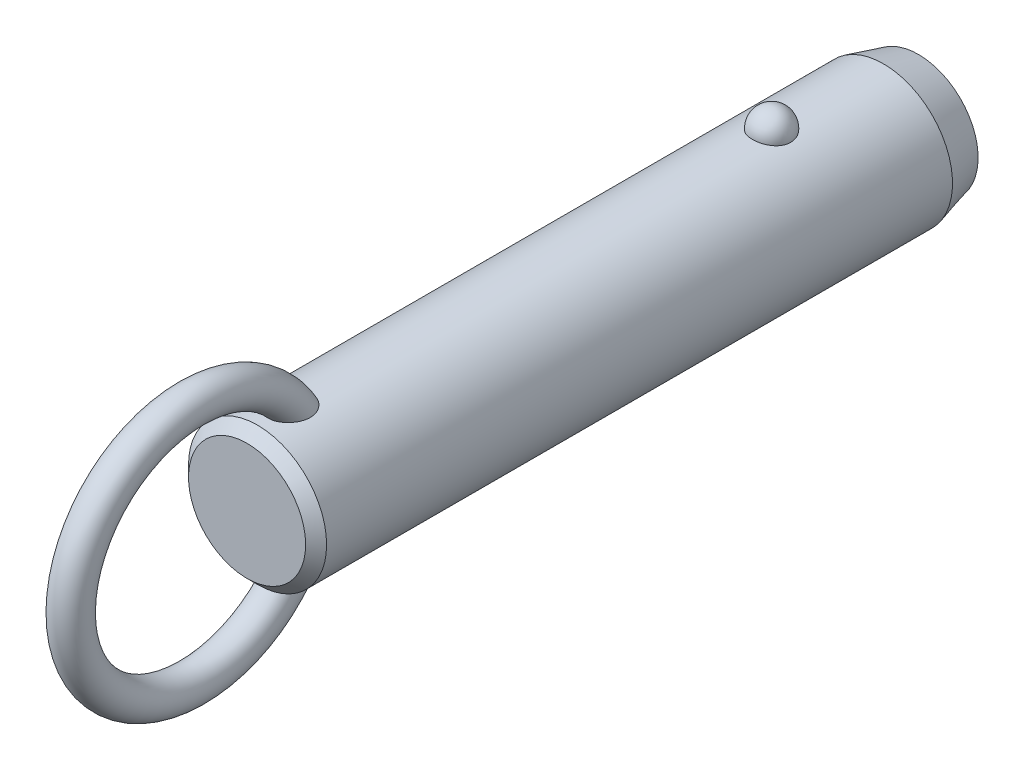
ISO-10303-21;
HEADER;
FILE_DESCRIPTION(('STEP AP214'),'2;1');
FILE_NAME('part.step','',(''),(''),'','','');
FILE_SCHEMA(('AUTOMOTIVE_DESIGN { 1 0 10303 214 1 1 1 1 }'));
ENDSEC;
DATA;
#1=APPLICATION_CONTEXT('core data for automotive mechanical design processes');
#2=APPLICATION_PROTOCOL_DEFINITION('international standard','automotive_design',2000,#1);
#3=PRODUCT_CONTEXT('',#1,'mechanical');
#4=PRODUCT('Part','Part','',(#3));
#5=PRODUCT_RELATED_PRODUCT_CATEGORY('part','',(#4));
#6=PRODUCT_DEFINITION_FORMATION('','',#4);
#7=PRODUCT_DEFINITION_CONTEXT('part definition',#1,'design');
#8=PRODUCT_DEFINITION('design','',#6,#7);
#9=PRODUCT_DEFINITION_SHAPE('','',#8);
#10=(LENGTH_UNIT() NAMED_UNIT(*) SI_UNIT(.MILLI.,.METRE.));
#11=(NAMED_UNIT(*) PLANE_ANGLE_UNIT() SI_UNIT($,.RADIAN.));
#12=(NAMED_UNIT(*) SI_UNIT($,.STERADIAN.) SOLID_ANGLE_UNIT());
#13=UNCERTAINTY_MEASURE_WITH_UNIT(LENGTH_MEASURE(1.E-05),#10,'distance_accuracy_value','');
#14=(GEOMETRIC_REPRESENTATION_CONTEXT(3) GLOBAL_UNCERTAINTY_ASSIGNED_CONTEXT((#13)) GLOBAL_UNIT_ASSIGNED_CONTEXT((#10,
#11,#12)) REPRESENTATION_CONTEXT('',''));
#15=CARTESIAN_POINT('',(0.,0.,0.));
#16=DIRECTION('',(0.,0.,1.));
#17=DIRECTION('',(1.,0.,0.));
#18=AXIS2_PLACEMENT_3D('',#15,#16,#17);
#19=CARTESIAN_POINT('',(0.,0.,48.3));
#20=DIRECTION('',(0.,0.,-1.));
#21=DIRECTION('',(-1.,0.,0.));
#22=AXIS2_PLACEMENT_3D('',#19,#20,#21);
#23=CYLINDRICAL_SURFACE('',#22,7.9);
#24=CARTESIAN_POINT('',(2.1785689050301,7.59367088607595,-2.2));
#25=CARTESIAN_POINT('',(2.17856679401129,7.59367269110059,-2.07701843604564));
#26=CARTESIAN_POINT('',(2.16853481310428,7.59657145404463,-1.95401006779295));
#27=CARTESIAN_POINT('',(2.12864689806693,7.607843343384,-1.71147811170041));
#28=CARTESIAN_POINT('',(2.09878338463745,7.61621856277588,-1.59195587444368));
#29=CARTESIAN_POINT('',(2.0199931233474,7.63749180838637,-1.35985638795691));
#30=CARTESIAN_POINT('',(1.97107475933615,7.6503878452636,-1.24727610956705));
#31=CARTESIAN_POINT('',(1.85539377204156,7.67926115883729,-1.03213234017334));
#32=CARTESIAN_POINT('',(1.78863158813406,7.69523835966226,-0.929568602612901));
#33=CARTESIAN_POINT('',(1.63856494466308,7.7285848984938,-0.736786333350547));
#34=CARTESIAN_POINT('',(1.55518140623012,7.7459606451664,-0.64663044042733));
#35=CARTESIAN_POINT('',(1.37422937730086,7.78009978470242,-0.481747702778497));
#36=CARTESIAN_POINT('',(1.27666086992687,7.79686317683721,-0.4070208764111));
#37=CARTESIAN_POINT('',(1.07024728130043,7.82786153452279,-0.275278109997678));
#38=CARTESIAN_POINT('',(0.961434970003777,7.84210353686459,-0.218212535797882));
#39=CARTESIAN_POINT('',(0.735351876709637,7.86652194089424,-0.123146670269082));
#40=CARTESIAN_POINT('',(0.618082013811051,7.87669878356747,-0.0851443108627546));
#41=CARTESIAN_POINT('',(0.380637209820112,7.89170521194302,-0.0298158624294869));
#42=CARTESIAN_POINT('',(0.260550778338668,7.89662650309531,-0.0121347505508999));
#43=CARTESIAN_POINT('',(0.0190117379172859,7.90090003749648,0.00324379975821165));
#44=CARTESIAN_POINT('',(-0.102440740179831,7.90025280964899,0.000943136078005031));
#45=CARTESIAN_POINT('',(-0.341452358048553,7.89351056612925,-0.0233955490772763));
#46=CARTESIAN_POINT('',(-0.459042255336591,7.88749257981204,-0.045154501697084));
#47=CARTESIAN_POINT('',(-0.688796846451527,7.87075812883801,-0.107408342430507));
#48=CARTESIAN_POINT('',(-0.800961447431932,7.86004158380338,-0.147903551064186));
#49=CARTESIAN_POINT('',(-1.01743634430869,7.83497131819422,-0.246799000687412));
#50=CARTESIAN_POINT('',(-1.12169791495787,7.82059709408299,-0.30530057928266));
#51=CARTESIAN_POINT('',(-1.31891765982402,7.78976470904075,-0.438549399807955));
#52=CARTESIAN_POINT('',(-1.41187469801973,7.77330633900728,-0.513298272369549));
#53=CARTESIAN_POINT('',(-1.58577142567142,7.73972434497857,-0.678622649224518));
#54=CARTESIAN_POINT('',(-1.66645140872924,7.72259402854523,-0.769470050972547));
#55=CARTESIAN_POINT('',(-1.81161503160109,7.68983776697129,-0.963538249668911));
#56=CARTESIAN_POINT('',(-1.87609753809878,7.6742119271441,-1.06675991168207));
#57=CARTESIAN_POINT('',(-1.98790138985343,7.6460202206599,-1.28401170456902));
#58=CARTESIAN_POINT('',(-2.03501994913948,7.63349104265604,-1.39815107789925));
#59=CARTESIAN_POINT('',(-2.10986724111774,7.6131449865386,-1.63301784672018));
#60=CARTESIAN_POINT('',(-2.1375965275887,7.60532797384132,-1.75374505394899));
#61=CARTESIAN_POINT('',(-2.17289256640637,7.59531950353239,-1.99782562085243));
#62=CARTESIAN_POINT('',(-2.18054294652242,7.59310471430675,-2.12116592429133));
#63=CARTESIAN_POINT('',(-2.17572919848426,7.59448538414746,-2.36741799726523));
#64=CARTESIAN_POINT('',(-2.1632656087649,7.59808068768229,-2.49032977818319));
#65=CARTESIAN_POINT('',(-2.11865035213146,7.61064035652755,-2.73161015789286));
#66=CARTESIAN_POINT('',(-2.08659579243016,7.61957823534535,-2.84999812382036));
#67=CARTESIAN_POINT('',(-2.00367799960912,7.64179982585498,-3.07955956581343));
#68=CARTESIAN_POINT('',(-1.9528140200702,7.65508371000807,-3.19073275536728));
#69=CARTESIAN_POINT('',(-1.83321113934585,7.68460381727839,-3.40337899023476));
#70=CARTESIAN_POINT('',(-1.76437735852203,7.70085556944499,-3.50479651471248));
#71=CARTESIAN_POINT('',(-1.61069526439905,7.73445734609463,-3.69446912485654));
#72=CARTESIAN_POINT('',(-1.52584634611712,7.75180741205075,-3.78272371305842));
#73=CARTESIAN_POINT('',(-1.34198059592,7.78574608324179,-3.94393987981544));
#74=CARTESIAN_POINT('',(-1.24291308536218,7.80233167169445,-4.01684434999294));
#75=CARTESIAN_POINT('',(-1.03352039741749,7.83281625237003,-4.14489386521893));
#76=CARTESIAN_POINT('',(-0.923196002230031,7.84671543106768,-4.20004014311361));
#77=CARTESIAN_POINT('',(-0.695822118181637,7.87011575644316,-4.29042017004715));
#78=CARTESIAN_POINT('',(-0.578872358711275,7.87966903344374,-4.32589112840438));
#79=CARTESIAN_POINT('',(-0.340410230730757,7.8935652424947,-4.37692226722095));
#80=CARTESIAN_POINT('',(-0.218898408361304,7.89790879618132,-4.39248482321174));
#81=CARTESIAN_POINT('',(0.0228107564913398,7.90087453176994,-4.40314405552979));
#82=CARTESIAN_POINT('',(0.142990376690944,7.89960185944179,-4.39861683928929));
#83=CARTESIAN_POINT('',(0.380829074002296,7.89171262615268,-4.37008293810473));
#84=CARTESIAN_POINT('',(0.498488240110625,7.8850962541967,-4.34607694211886));
#85=CARTESIAN_POINT('',(0.727535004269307,7.86726442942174,-4.27939317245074));
#86=CARTESIAN_POINT('',(0.838944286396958,7.85606616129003,-4.23678512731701));
#87=CARTESIAN_POINT('',(1.05295421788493,7.83025654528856,-4.13408348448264));
#88=CARTESIAN_POINT('',(1.15555431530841,7.81564498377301,-4.07398879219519));
#89=CARTESIAN_POINT('',(1.35076763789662,7.7843022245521,-3.93687432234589));
#90=CARTESIAN_POINT('',(1.4432046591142,7.76754209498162,-3.85961036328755));
#91=CARTESIAN_POINT('',(1.6139111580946,7.73387857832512,-3.69076949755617));
#92=CARTESIAN_POINT('',(1.6921781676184,7.71697516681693,-3.59919010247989));
#93=CARTESIAN_POINT('',(1.83380875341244,7.6845643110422,-3.40247278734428));
#94=CARTESIAN_POINT('',(1.89689280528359,7.66908588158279,-3.29712873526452));
#95=CARTESIAN_POINT('',(2.0047823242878,7.64159441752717,-3.07707931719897));
#96=CARTESIAN_POINT('',(2.0495945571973,7.62958010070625,-2.96237743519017));
#97=CARTESIAN_POINT('',(2.11580183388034,7.61146617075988,-2.74040519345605));
#98=CARTESIAN_POINT('',(2.13929812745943,7.60484503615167,-2.63379846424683));
#99=CARTESIAN_POINT('',(2.17068242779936,7.59594664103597,-2.41813481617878));
#100=CARTESIAN_POINT('',(2.17857077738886,7.59366928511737,-2.30907795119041));
#101=CARTESIAN_POINT('',(2.1785689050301,7.59367088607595,-2.2));
#102=B_SPLINE_CURVE_WITH_KNOTS('',3,(#24,#25,#26,#27,#28,#29,#30,#31,#32,#33,#34,#35,#36,#37,
#38,#39,#40,#41,#42,#43,#44,#45,#46,#47,#48,#49,#50,#51,#52,#53,#54,#55,#56,#57,#58,#59,#60,#61,
#62,#63,#64,#65,#66,#67,#68,#69,#70,#71,#72,#73,#74,#75,#76,#77,#78,#79,#80,#81,#82,#83,#84,#85,
#86,#87,#88,#89,#90,#91,#92,#93,#94,#95,#96,#97,#98,#99,#100,#101),.UNSPECIFIED.,.T.,.F.,(4,2,2,
2,2,2,2,2,2,2,2,2,2,2,2,2,2,2,2,2,2,2,2,2,2,2,2,2,2,2,2,2,2,2,2,2,2,2,4),(0.,0.368552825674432,
0.737246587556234,1.10577831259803,1.4743009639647,1.84462067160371,2.21494081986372,
2.5842105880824,2.95344028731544,3.31611630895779,3.67875788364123,4.03628044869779,
4.39380913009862,4.75338791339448,5.11300280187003,5.47939989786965,5.8458226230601,
6.21639834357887,6.58696347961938,6.95598276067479,7.32499216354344,7.69218715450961,
8.0593967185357,8.42858578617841,8.79778880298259,9.16834203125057,9.5388695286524,
9.90482699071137,10.2707407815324,10.6298333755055,10.9889132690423,11.3466585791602,
11.7044262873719,12.0676511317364,12.4309391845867,12.8004764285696,13.1698767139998,
13.4967701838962,13.8236564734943),.UNSPECIFIED.);
#103=CARTESIAN_POINT('',(2.1785689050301,7.59367088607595,-2.2));
#104=VERTEX_POINT('',#103);
#105=EDGE_CURVE('E41',#104,#104,#102,.T.);
#106=ORIENTED_EDGE('',*,*,#105,.T.);
#107=EDGE_LOOP('',(#106));
#108=FACE_BOUND('',#107,.T.);
#109=CARTESIAN_POINT('',(0.,0.,56.62));
#110=DIRECTION('',(0.,0.,1.));
#111=DIRECTION('',(1.,0.,0.));
#112=AXIS2_PLACEMENT_3D('',#109,#110,#111);
#113=CIRCLE('',#112,7.9);
#114=CARTESIAN_POINT('',(7.9,0.,56.62));
#115=VERTEX_POINT('',#114);
#116=EDGE_CURVE('E10',#115,#115,#113,.F.);
#117=ORIENTED_EDGE('',*,*,#116,.T.);
#118=EDGE_LOOP('',(#117));
#119=FACE_BOUND('',#118,.T.);
#120=CARTESIAN_POINT('',(-0.630969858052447,-7.87476203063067,50.5124322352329));
#121=CARTESIAN_POINT('',(-0.734180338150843,-7.8664899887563,50.547285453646));
#122=CARTESIAN_POINT('',(-0.83447695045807,-7.85639291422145,50.5908160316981));
#123=CARTESIAN_POINT('',(-1.0262035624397,-7.83366343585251,50.694094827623));
#124=CARTESIAN_POINT('',(-1.1176141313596,-7.82102565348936,50.7538775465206));
#125=CARTESIAN_POINT('',(-1.28877277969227,-7.79464922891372,50.8878390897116));
#126=CARTESIAN_POINT('',(-1.36854014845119,-7.78091246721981,50.961993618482));
#127=CARTESIAN_POINT('',(-1.51461521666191,-7.75380398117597,51.1224941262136));
#128=CARTESIAN_POINT('',(-1.58092966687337,-7.74043207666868,51.2088339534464));
#129=CARTESIAN_POINT('',(-1.70019064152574,-7.71512522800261,51.3929784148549));
#130=CARTESIAN_POINT('',(-1.75284037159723,-7.70322473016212,51.4909792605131));
#131=CARTESIAN_POINT('',(-1.84263464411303,-7.68224112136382,51.6941029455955));
#132=CARTESIAN_POINT('',(-1.87977299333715,-7.6731591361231,51.7992286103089));
#133=CARTESIAN_POINT('',(-1.94152728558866,-7.65777930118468,52.0232849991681));
#134=CARTESIAN_POINT('',(-1.96475471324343,-7.65179654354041,52.1426167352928));
#135=CARTESIAN_POINT('',(-1.99449499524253,-7.64409642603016,52.3834298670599));
#136=CARTESIAN_POINT('',(-2.0010005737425,-7.64238092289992,52.5049121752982));
#137=CARTESIAN_POINT('',(-1.99856014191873,-7.64302120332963,52.7683409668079));
#138=CARTESIAN_POINT('',(-1.98680021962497,-7.64611845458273,52.9102565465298));
#139=CARTESIAN_POINT('',(-1.94457772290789,-7.65696186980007,53.1911188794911));
#140=CARTESIAN_POINT('',(-1.91409393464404,-7.66471330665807,53.3300620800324));
#141=CARTESIAN_POINT('',(-1.82768670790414,-7.68582947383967,53.631939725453));
#142=CARTESIAN_POINT('',(-1.76772963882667,-7.70003779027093,53.793686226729));
#143=CARTESIAN_POINT('',(-1.65998501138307,-7.72371550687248,54.0276956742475));
#144=CARTESIAN_POINT('',(-1.621079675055,-7.73200670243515,54.1042974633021));
#145=CARTESIAN_POINT('',(-1.53727726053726,-7.74910377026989,54.2540798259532));
#146=CARTESIAN_POINT('',(-1.49238215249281,-7.75790947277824,54.3272615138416));
#147=CARTESIAN_POINT('',(-1.37397050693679,-7.77993338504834,54.5028838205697));
#148=CARTESIAN_POINT('',(-1.29690364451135,-7.79328473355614,54.6029557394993));
#149=CARTESIAN_POINT('',(-1.12885487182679,-7.81939266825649,54.7907147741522));
#150=CARTESIAN_POINT('',(-1.03789926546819,-7.83215032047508,54.8784247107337));
#151=CARTESIAN_POINT('',(-0.869532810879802,-7.85231710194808,55.0134148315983));
#152=CARTESIAN_POINT('',(-0.795716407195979,-7.86021093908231,55.065076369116));
#153=CARTESIAN_POINT('',(-0.640813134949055,-7.87434920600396,55.1563815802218));
#154=CARTESIAN_POINT('',(-0.559737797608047,-7.88059619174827,55.1960438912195));
#155=CARTESIAN_POINT('',(-0.406456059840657,-7.88984116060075,55.2543008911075));
#156=CARTESIAN_POINT('',(-0.335227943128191,-7.89321892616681,55.2753848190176));
#157=CARTESIAN_POINT('',(-0.190193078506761,-7.89804235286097,55.3054141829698));
#158=CARTESIAN_POINT('',(-0.116388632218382,-7.89948969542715,55.3143701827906));
#159=CARTESIAN_POINT('',(0.0318414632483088,-7.90028409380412,55.3192915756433));
#160=CARTESIAN_POINT('',(0.106268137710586,-7.89962640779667,55.3152276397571));
#161=CARTESIAN_POINT('',(0.25329066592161,-7.8962818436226,55.2944615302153));
#162=CARTESIAN_POINT('',(0.325885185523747,-7.8935935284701,55.2777504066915));
#163=CARTESIAN_POINT('',(0.48144171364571,-7.88577340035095,55.2287380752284));
#164=CARTESIAN_POINT('',(0.563611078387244,-7.88026321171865,55.194005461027));
#165=CARTESIAN_POINT('',(0.721129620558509,-7.86741729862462,55.1117965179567));
#166=CARTESIAN_POINT('',(0.796466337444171,-7.86007832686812,55.0642975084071));
#167=CARTESIAN_POINT('',(0.971456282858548,-7.84073285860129,54.936513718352));
#168=CARTESIAN_POINT('',(1.06719686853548,-7.82809461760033,54.8510047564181));
#169=CARTESIAN_POINT('',(1.24418921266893,-7.80192439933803,54.666232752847));
#170=CARTESIAN_POINT('',(1.32540832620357,-7.78839049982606,54.5669395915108));
#171=CARTESIAN_POINT('',(1.45199971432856,-7.76559693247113,54.3895760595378));
#172=CARTESIAN_POINT('',(1.50085649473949,-7.75626094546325,54.3139542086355));
#173=CARTESIAN_POINT('',(1.59197749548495,-7.7380727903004,54.1587428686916));
#174=CARTESIAN_POINT('',(1.63423919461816,-7.72922080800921,54.0791518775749));
#175=CARTESIAN_POINT('',(1.71222612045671,-7.71231959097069,53.9166640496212));
#176=CARTESIAN_POINT('',(1.74794516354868,-7.70427111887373,53.833764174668));
#177=CARTESIAN_POINT('',(1.81270113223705,-7.68929240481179,53.6652967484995));
#178=CARTESIAN_POINT('',(1.84173789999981,-7.68236218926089,53.5797291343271));
#179=CARTESIAN_POINT('',(1.89322698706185,-7.6698375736,53.4052870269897));
#180=CARTESIAN_POINT('',(1.91558744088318,-7.66426199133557,53.3163838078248));
#181=CARTESIAN_POINT('',(1.95281367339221,-7.65485915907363,53.1369696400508));
#182=CARTESIAN_POINT('',(1.96767946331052,-7.65103190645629,53.0464586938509));
#183=CARTESIAN_POINT('',(2.0002145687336,-7.64262981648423,52.7737320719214));
#184=CARTESIAN_POINT('',(2.00600691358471,-7.6410871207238,52.5897099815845));
#185=CARTESIAN_POINT('',(1.98445334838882,-7.64669564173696,52.2765019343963));
#186=CARTESIAN_POINT('',(1.96607186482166,-7.65149688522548,52.146618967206));
#187=CARTESIAN_POINT('',(1.90884967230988,-7.66597624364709,51.8916321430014));
#188=CARTESIAN_POINT('',(1.87002101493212,-7.67565148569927,51.766525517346));
#189=CARTESIAN_POINT('',(1.77063986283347,-7.69918471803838,51.5245401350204));
#190=CARTESIAN_POINT('',(1.70993724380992,-7.71307150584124,51.4077250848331));
#191=CARTESIAN_POINT('',(1.56733070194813,-7.74330306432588,51.1881444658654));
#192=CARTESIAN_POINT('',(1.48543692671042,-7.75964665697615,51.0853722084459));
#193=CARTESIAN_POINT('',(1.31346177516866,-7.79047523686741,50.9093800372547));
#194=CARTESIAN_POINT('',(1.22547278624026,-7.80495298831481,50.8341066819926));
#195=CARTESIAN_POINT('',(1.0372435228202,-7.83218597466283,50.7004864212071));
#196=CARTESIAN_POINT('',(0.937008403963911,-7.84494192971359,50.6421324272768));
#197=CARTESIAN_POINT('',(0.733599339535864,-7.86649045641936,50.5470270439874));
#198=CARTESIAN_POINT('',(0.630941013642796,-7.87547134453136,50.5092109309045));
#199=CARTESIAN_POINT('',(0.420465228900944,-7.88950708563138,50.4511160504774));
#200=CARTESIAN_POINT('',(0.312645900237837,-7.89456050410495,50.4308436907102));
#201=CARTESIAN_POINT('',(0.0960869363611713,-7.9001518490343,50.4084559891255));
#202=CARTESIAN_POINT('',(-0.0126341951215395,-7.90073226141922,50.4061698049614));
#203=CARTESIAN_POINT('',(-0.228766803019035,-7.89742350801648,50.4193678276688));
#204=CARTESIAN_POINT('',(-0.336180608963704,-7.89354403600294,50.4348134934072));
#205=CARTESIAN_POINT('',(-0.473410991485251,-7.88586871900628,50.4662177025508));
#206=CARTESIAN_POINT('',(-0.505257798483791,-7.88388984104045,50.4743541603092));
#207=CARTESIAN_POINT('',(-0.568481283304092,-7.87958326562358,50.4922083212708));
#208=CARTESIAN_POINT('',(-0.599857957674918,-7.87725556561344,50.5019260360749));
#209=CARTESIAN_POINT('',(-0.630969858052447,-7.87476203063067,50.5124322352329));
#210=B_SPLINE_CURVE_WITH_KNOTS('',3,(#120,#121,#122,#123,#124,#125,#126,#127,#128,#129,#130,
#131,#132,#133,#134,#135,#136,#137,#138,#139,#140,#141,#142,#143,#144,#145,#146,#147,#148,#149,
#150,#151,#152,#153,#154,#155,#156,#157,#158,#159,#160,#161,#162,#163,#164,#165,#166,#167,#168,
#169,#170,#171,#172,#173,#174,#175,#176,#177,#178,#179,#180,#181,#182,#183,#184,#185,#186,#187,
#188,#189,#190,#191,#192,#193,#194,#195,#196,#197,#198,#199,#200,#201,#202,#203,#204,#205,#206,
#207,#208,#209),.UNSPECIFIED.,.T.,.F.,(4,2,2,2,2,2,2,2,2,2,2,2,2,2,2,2,2,2,2,2,2,2,2,2,2,2,2,2,
2,2,2,2,2,2,2,2,2,2,2,2,2,2,2,2,4),(0.,0.327622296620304,0.655945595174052,0.983718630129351,
1.3113267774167,1.64554655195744,1.97989964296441,2.34365728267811,2.70757317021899,
3.13333684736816,3.55958380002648,4.07655306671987,4.3352789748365,4.593919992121,
4.9738243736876,5.35301797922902,5.62348245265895,5.89352465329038,6.11565959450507,
6.3376009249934,6.56004255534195,6.782641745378,7.04930844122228,7.31645206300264,
7.70130871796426,8.08701995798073,8.35824509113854,8.62957365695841,8.90115735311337,
9.17274746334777,9.44791855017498,9.72308922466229,10.2715298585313,10.6638393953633,
11.0559179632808,11.4507403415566,11.8453740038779,12.1936425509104,12.5417649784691,
12.8695063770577,13.1973674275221,13.5221104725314,13.8461490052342,13.9449071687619,
14.0436660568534),.UNSPECIFIED.);
#211=CARTESIAN_POINT('',(-0.630969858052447,-7.87476203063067,50.5124322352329));
#212=VERTEX_POINT('',#211);
#213=EDGE_CURVE('E59',#212,#212,#210,.T.);
#214=ORIENTED_EDGE('',*,*,#213,.T.);
#215=EDGE_LOOP('',(#214));
#216=FACE_BOUND('',#215,.T.);
#217=CARTESIAN_POINT('',(-0.630969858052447,7.87476203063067,50.5124322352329));
#218=CARTESIAN_POINT('',(-0.528918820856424,7.88293636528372,50.4779798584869));
#219=CARTESIAN_POINT('',(-0.423745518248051,7.8893481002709,50.451915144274));
#220=CARTESIAN_POINT('',(-0.210236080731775,7.8979273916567,50.4172825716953));
#221=CARTESIAN_POINT('',(-0.101893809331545,7.90008607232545,50.4087513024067));
#222=CARTESIAN_POINT('',(0.114660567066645,7.89990877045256,50.4094570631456));
#223=CARTESIAN_POINT('',(0.22287270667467,7.89757640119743,50.4186798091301));
#224=CARTESIAN_POINT('',(0.436107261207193,7.88867538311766,50.4546525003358));
#225=CARTESIAN_POINT('',(0.541131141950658,7.8821087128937,50.4813942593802));
#226=CARTESIAN_POINT('',(0.745085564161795,7.86545130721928,50.5517561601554));
#227=CARTESIAN_POINT('',(0.844015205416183,7.85536005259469,50.5953787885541));
#228=CARTESIAN_POINT('',(1.03299167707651,7.83275153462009,50.6983796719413));
#229=CARTESIAN_POINT('',(1.12303841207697,7.8202342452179,50.7577580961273));
#230=CARTESIAN_POINT('',(1.29214734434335,7.79408219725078,50.8908647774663));
#231=CARTESIAN_POINT('',(1.37116907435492,7.78044359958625,50.9646436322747));
#232=CARTESIAN_POINT('',(1.51597677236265,7.75353170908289,51.1242353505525));
#233=CARTESIAN_POINT('',(1.58176261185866,7.74025841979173,51.2100483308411));
#234=CARTESIAN_POINT('',(1.70057386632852,7.71504069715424,51.393644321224));
#235=CARTESIAN_POINT('',(1.75320073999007,7.7031425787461,51.4916906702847));
#236=CARTESIAN_POINT('',(1.8429376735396,7.68216822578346,51.6948931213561));
#237=CARTESIAN_POINT('',(1.88004278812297,7.67309289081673,51.8000514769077));
#238=CARTESIAN_POINT('',(1.9417232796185,7.6577294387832,52.0241671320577));
#239=CARTESIAN_POINT('',(1.96491037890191,7.65175648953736,52.1435248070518));
#240=CARTESIAN_POINT('',(1.9945689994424,7.64407702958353,52.3843848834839));
#241=CARTESIAN_POINT('',(2.00103304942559,7.64237242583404,52.5058882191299));
#242=CARTESIAN_POINT('',(1.99850166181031,7.64303650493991,52.7693688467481));
#243=CARTESIAN_POINT('',(1.98669038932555,7.64614714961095,52.9113141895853));
#244=CARTESIAN_POINT('',(1.94436120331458,7.6570170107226,53.1922287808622));
#245=CARTESIAN_POINT('',(1.91382203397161,7.66478150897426,53.3311944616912));
#246=CARTESIAN_POINT('',(1.82728754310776,7.68592483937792,53.6331110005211));
#247=CARTESIAN_POINT('',(1.76725778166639,7.7001468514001,53.7948721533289));
#248=CARTESIAN_POINT('',(1.65939700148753,7.72384204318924,54.0288914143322));
#249=CARTESIAN_POINT('',(1.62045187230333,7.73213852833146,54.1054942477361));
#250=CARTESIAN_POINT('',(1.5365668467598,7.74924489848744,54.2552737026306));
#251=CARTESIAN_POINT('',(1.49162892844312,7.75805461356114,54.3284514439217));
#252=CARTESIAN_POINT('',(1.37317698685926,7.78007342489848,54.5039520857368));
#253=CARTESIAN_POINT('',(1.29612360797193,7.79341423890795,54.6039112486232));
#254=CARTESIAN_POINT('',(1.12812043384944,7.81949839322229,54.7914508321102));
#255=CARTESIAN_POINT('',(1.03719688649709,7.83224280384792,54.8790540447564));
#256=CARTESIAN_POINT('',(0.868871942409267,7.85239026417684,55.0138971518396));
#257=CARTESIAN_POINT('',(0.795056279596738,7.86027769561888,55.0655113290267));
#258=CARTESIAN_POINT('',(0.640160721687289,7.87440222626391,55.1567201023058));
#259=CARTESIAN_POINT('',(0.559092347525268,7.88064188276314,55.1963333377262));
#260=CARTESIAN_POINT('',(0.40582092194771,7.8898738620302,55.2545056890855));
#261=CARTESIAN_POINT('',(0.334594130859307,7.89324577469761,55.2755523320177));
#262=CARTESIAN_POINT('',(0.189568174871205,7.89805733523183,55.3055070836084));
#263=CARTESIAN_POINT('',(0.115771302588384,7.89949866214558,55.3144257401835));
#264=CARTESIAN_POINT('',(-0.0324359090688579,7.90028156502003,55.3192758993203));
#265=CARTESIAN_POINT('',(-0.106847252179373,7.89961843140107,55.3151782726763));
#266=CARTESIAN_POINT('',(-0.253834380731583,7.8962642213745,55.2943519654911));
#267=CARTESIAN_POINT('',(-0.326408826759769,7.89357170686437,55.2776143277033));
#268=CARTESIAN_POINT('',(-0.481962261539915,7.88574179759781,55.2285391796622));
#269=CARTESIAN_POINT('',(-0.564145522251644,7.88022507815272,55.1937638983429));
#270=CARTESIAN_POINT('',(-0.72168526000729,7.86736646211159,55.1114686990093));
#271=CARTESIAN_POINT('',(-0.797029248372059,7.8600213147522,55.0639260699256));
#272=CARTESIAN_POINT('',(-0.9720442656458,7.84066026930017,54.9360267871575));
#273=CARTESIAN_POINT('',(-1.06779803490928,7.82801274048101,54.8504436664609));
#274=CARTESIAN_POINT('',(-1.2448053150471,7.80182621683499,54.6655223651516));
#275=CARTESIAN_POINT('',(-1.32602618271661,7.78828530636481,54.5661540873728));
#276=CARTESIAN_POINT('',(-1.45259834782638,7.76548487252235,54.3886806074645));
#277=CARTESIAN_POINT('',(-1.50143856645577,7.75614818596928,54.3130252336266));
#278=CARTESIAN_POINT('',(-1.59252410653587,7.73796020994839,54.1577484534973));
#279=CARTESIAN_POINT('',(-1.63476690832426,7.72910910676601,54.0781255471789));
#280=CARTESIAN_POINT('',(-1.71271318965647,7.71221133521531,53.9155750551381));
#281=CARTESIAN_POINT('',(-1.7484104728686,7.70416543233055,53.8326444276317));
#282=CARTESIAN_POINT('',(-1.81311929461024,7.6891937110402,53.6641168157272));
#283=CARTESIAN_POINT('',(-1.84213067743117,7.6822679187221,53.5785197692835));
#284=CARTESIAN_POINT('',(-1.89356259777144,7.66975461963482,53.4040254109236));
#285=CARTESIAN_POINT('',(-1.91589165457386,7.66418586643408,53.3150995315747));
#286=CARTESIAN_POINT('',(-1.95305070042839,7.65479859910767,53.1356424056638));
#287=CARTESIAN_POINT('',(-1.96788069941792,7.65098008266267,53.0451111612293));
#288=CARTESIAN_POINT('',(-2.00030078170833,7.64260704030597,52.7723270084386));
#289=CARTESIAN_POINT('',(-2.00600576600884,7.64108760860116,52.5882718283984));
#290=CARTESIAN_POINT('',(-1.98428483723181,7.64673945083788,52.2750800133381));
#291=CARTESIAN_POINT('',(-1.96583698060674,7.65155751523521,52.1452400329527));
#292=CARTESIAN_POINT('',(-1.90848948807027,7.66606613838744,51.8903619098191));
#293=CARTESIAN_POINT('',(-1.86960376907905,7.67575338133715,51.765320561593));
#294=CARTESIAN_POINT('',(-1.77013421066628,7.6993013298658,51.5235009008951));
#295=CARTESIAN_POINT('',(-1.70940488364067,7.71318991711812,51.4067844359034));
#296=CARTESIAN_POINT('',(-1.56672953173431,7.74342495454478,51.1873404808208));
#297=CARTESIAN_POINT('',(-1.48478316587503,7.75977144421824,51.0846132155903));
#298=CARTESIAN_POINT('',(-1.31266325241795,7.79061163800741,50.908643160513));
#299=CARTESIAN_POINT('',(-1.22456383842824,7.80509908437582,50.8333589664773));
#300=CARTESIAN_POINT('',(-1.0362240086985,7.83231881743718,50.6998659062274));
#301=CARTESIAN_POINT('',(-0.936015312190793,7.84505551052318,50.6416137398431));
#302=CARTESIAN_POINT('',(-0.798824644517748,7.85957802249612,50.5775408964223));
#303=CARTESIAN_POINT('',(-0.765787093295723,7.86286821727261,50.5632248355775));
#304=CARTESIAN_POINT('',(-0.698939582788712,7.86909211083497,50.536436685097));
#305=CARTESIAN_POINT('',(-0.665129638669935,7.8720258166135,50.5239645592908));
#306=CARTESIAN_POINT('',(-0.630969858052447,7.87476203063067,50.5124322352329));
#307=B_SPLINE_CURVE_WITH_KNOTS('',3,(#217,#218,#219,#220,#221,#222,#223,#224,#225,#226,#227,
#228,#229,#230,#231,#232,#233,#234,#235,#236,#237,#238,#239,#240,#241,#242,#243,#244,#245,#246,
#247,#248,#249,#250,#251,#252,#253,#254,#255,#256,#257,#258,#259,#260,#261,#262,#263,#264,#265,
#266,#267,#268,#269,#270,#271,#272,#273,#274,#275,#276,#277,#278,#279,#280,#281,#282,#283,#284,
#285,#286,#287,#288,#289,#290,#291,#292,#293,#294,#295,#296,#297,#298,#299,#300,#301,#302,#303,
#304,#305,#306),.UNSPECIFIED.,.T.,.F.,(4,2,2,2,2,2,2,2,2,2,2,2,2,2,2,2,2,2,2,2,2,2,2,2,2,2,2,2,
2,2,2,2,2,2,2,2,2,2,2,2,2,2,2,2,4),(0.,0.32392037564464,0.64851603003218,0.972850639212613,
1.29703380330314,1.62126473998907,1.94549915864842,2.27089401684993,2.59629203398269,
2.93059633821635,3.26500707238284,3.6288164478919,3.99278833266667,4.41865421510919,
4.84500434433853,5.36209210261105,5.62087589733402,5.87957448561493,6.25918598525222,
6.63808782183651,6.90846748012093,7.17842501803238,7.40052350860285,7.62242871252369,
7.84483086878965,8.0673907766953,8.33414615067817,8.60137921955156,8.98641454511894,
9.37230415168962,9.64358673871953,9.91497268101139,10.1866142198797,10.4582620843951,
10.7334745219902,11.008686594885,11.5572126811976,11.9494246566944,12.3413699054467,
12.7359755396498,13.1305875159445,13.4791770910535,13.82687259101,13.9353013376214,
14.0437279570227),.UNSPECIFIED.);
#308=CARTESIAN_POINT('',(-0.630969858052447,7.87476203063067,50.5124322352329));
#309=VERTEX_POINT('',#308);
#310=EDGE_CURVE('E67',#309,#309,#307,.T.);
#311=ORIENTED_EDGE('',*,*,#310,.T.);
#312=EDGE_LOOP('',(#311));
#313=FACE_BOUND('',#312,.T.);
#314=CARTESIAN_POINT('',(0.,0.,-15.));
#315=DIRECTION('',(0.,0.,-1.));
#316=DIRECTION('',(-1.,0.,0.));
#317=AXIS2_PLACEMENT_3D('',#314,#315,#316);
#318=CIRCLE('',#317,7.9);
#319=CARTESIAN_POINT('',(-7.9,0.,-15.));
#320=VERTEX_POINT('',#319);
#321=EDGE_CURVE('E56',#320,#320,#318,.F.);
#322=ORIENTED_EDGE('',*,*,#321,.T.);
#323=EDGE_LOOP('',(#322));
#324=FACE_BOUND('',#323,.T.);
#325=ADVANCED_FACE('F37',(#108,#119,#216,#313,#324),#23,.T.);
#326=CARTESIAN_POINT('',(0.,0.,-19.));
#327=DIRECTION('',(0.,0.,-1.));
#328=DIRECTION('',(-1.,0.,0.));
#329=AXIS2_PLACEMENT_3D('',#326,#327,#328);
#330=PLANE('',#329);
#331=CARTESIAN_POINT('',(0.,0.,-19.));
#332=DIRECTION('',(0.,0.,-1.));
#333=DIRECTION('',(-1.,0.,0.));
#334=AXIS2_PLACEMENT_3D('',#331,#332,#333);
#335=CIRCLE('',#334,6.82820323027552);
#336=CARTESIAN_POINT('',(-6.82820323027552,0.,-19.));
#337=VERTEX_POINT('',#336);
#338=EDGE_CURVE('E66',#337,#337,#335,.T.);
#339=ORIENTED_EDGE('',*,*,#338,.T.);
#340=EDGE_LOOP('',(#339));
#341=FACE_BOUND('',#340,.T.);
#342=ADVANCED_FACE('F85',(#341),#330,.T.);
#343=CARTESIAN_POINT('',(0.,0.,-19.));
#344=DIRECTION('',(0.,0.,1.));
#345=DIRECTION('',(1.,0.,0.));
#346=AXIS2_PLACEMENT_3D('',#343,#344,#345);
#347=CONICAL_SURFACE('',#346,6.82820323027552,0.261799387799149);
#348=ORIENTED_EDGE('',*,*,#321,.F.);
#349=EDGE_LOOP('',(#348));
#350=FACE_BOUND('',#349,.T.);
#351=ORIENTED_EDGE('',*,*,#338,.F.);
#352=EDGE_LOOP('',(#351));
#353=FACE_BOUND('',#352,.T.);
#354=ADVANCED_FACE('F83',(#350,#353),#347,.T.);
#355=CARTESIAN_POINT('',(0.,0.,57.82));
#356=DIRECTION('',(0.,0.,1.));
#357=DIRECTION('',(1.,0.,0.));
#358=AXIS2_PLACEMENT_3D('',#355,#356,#357);
#359=PLANE('',#358);
#360=CARTESIAN_POINT('',(0.,0.,57.82));
#361=DIRECTION('',(0.,0.,1.));
#362=DIRECTION('',(1.,0.,0.));
#363=AXIS2_PLACEMENT_3D('',#360,#361,#362);
#364=CIRCLE('',#363,6.70000000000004);
#365=CARTESIAN_POINT('',(6.70000000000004,0.,57.82));
#366=VERTEX_POINT('',#365);
#367=EDGE_CURVE('E50',#366,#366,#364,.T.);
#368=ORIENTED_EDGE('',*,*,#367,.T.);
#369=EDGE_LOOP('',(#368));
#370=FACE_BOUND('',#369,.T.);
#371=ADVANCED_FACE('F77',(#370),#359,.T.);
#372=CARTESIAN_POINT('',(0.,0.,64.15));
#373=DIRECTION('',(1.,0.,0.));
#374=DIRECTION('',(0.,0.,-1.));
#375=AXIS2_PLACEMENT_3D('',#372,#373,#374);
#376=TOROIDAL_SURFACE('',#375,13.85,2.);
#377=ORIENTED_EDGE('',*,*,#310,.F.);
#378=EDGE_LOOP('',(#377));
#379=FACE_BOUND('',#378,.T.);
#380=ORIENTED_EDGE('',*,*,#213,.F.);
#381=EDGE_LOOP('',(#380));
#382=FACE_BOUND('',#381,.T.);
#383=ADVANCED_FACE('F73',(#379,#382),#376,.T.);
#384=CARTESIAN_POINT('',(0.,0.,57.82));
#385=DIRECTION('',(0.,0.,-1.));
#386=DIRECTION('',(-1.,0.,0.));
#387=AXIS2_PLACEMENT_3D('',#384,#385,#386);
#388=CONICAL_SURFACE('',#387,6.70000000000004,0.785398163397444);
#389=ORIENTED_EDGE('',*,*,#116,.F.);
#390=EDGE_LOOP('',(#389));
#391=FACE_BOUND('',#390,.T.);
#392=ORIENTED_EDGE('',*,*,#367,.F.);
#393=EDGE_LOOP('',(#392));
#394=FACE_BOUND('',#393,.T.);
#395=ADVANCED_FACE('F39',(#391,#394),#388,.T.);
#396=CARTESIAN_POINT('',(0.,7.9,-2.2));
#397=DIRECTION('',(0.,1.,0.));
#398=DIRECTION('',(0.,0.,-1.));
#399=AXIS2_PLACEMENT_3D('',#396,#397,#398);
#400=SPHERICAL_SURFACE('',#399,2.2);
#401=ORIENTED_EDGE('',*,*,#105,.F.);
#402=EDGE_LOOP('',(#401));
#403=FACE_BOUND('',#402,.T.);
#404=ADVANCED_FACE('F79',(#403),#400,.T.);
#405=CLOSED_SHELL('',(#325,#342,#354,#371,#383,#395,#404));
#406=MANIFOLD_SOLID_BREP('B2',#405);
#407=ADVANCED_BREP_SHAPE_REPRESENTATION('',(#18,#406),#14);
#408=SHAPE_DEFINITION_REPRESENTATION(#9,#407);
ENDSEC;
END-ISO-10303-21;
